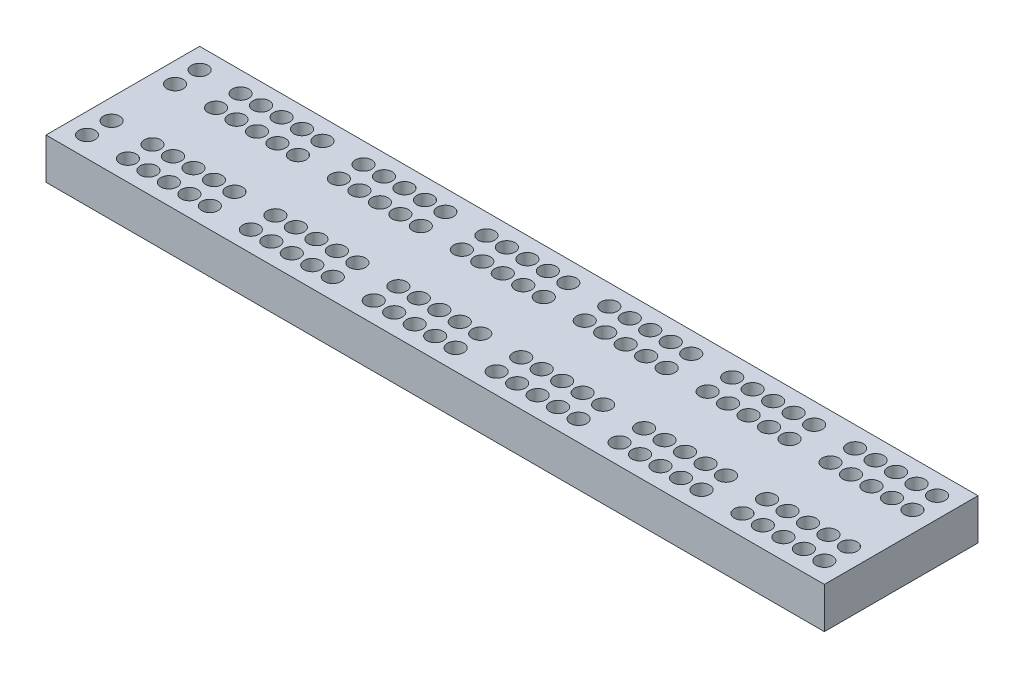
from build123d import *

# Parameters (mm, degrees)
SKETCH1_W            = 75
SKETCH1_H            = 20
BOSS_EXTRUDE1_DEPTH  = 190
LPATTERN1_COUNT      = 37
LPATTERN1_PITCH      = 10
LPATTERN1_COUNT_DIR2 = 2
LPATTERN1_PITCH_DIR2 = 12


with BuildPart() as part:
    # Sketch1 → Boss-Extrude1 (new, symmetric)
    with BuildSketch(Plane(origin=(0, 0, 0), x_dir=(0, 0, -1), z_dir=(1, 0, 0))):
        Rectangle(SKETCH1_W, SKETCH1_H)
    extrude(amount=BOSS_EXTRUDE1_DEPTH, both=True)

    # Sketch2 → 8.0 _8_ Diameter Hole1 (revolve, cut)
    with BuildSketch(Plane(origin=(-180, 10, -27.5), x_dir=(0, 0, 1), z_dir=(1, 0, 0))):
        Polygon((0, 0), (0, 14.403442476), (4, 12), (4, 0), align=None)
    f_8_0_8_diameter_hole1 = revolve(axis=Axis((-180, 16.35, -27.5), (0, -1, 0)), mode=Mode.SUBTRACT)

    # LPattern1: 8.0 _8_ Diameter Hole1 37 × 2, 12 skipped
    with Locations(*[(i * LPATTERN1_PITCH, 0, j * LPATTERN1_PITCH_DIR2) for i in range(LPATTERN1_COUNT) for j in range(LPATTERN1_COUNT_DIR2) if (i, j) not in ((0, 0), (1, 0), (1, 1), (7, 0), (7, 1), (13, 0), (13, 1), (19, 0), (19, 1), (25, 0), (25, 1), (31, 0), (31, 1))]):
        add(f_8_0_8_diameter_hole1, mode=Mode.SUBTRACT)

    # Mirror1: 8.0 _8_ Diameter Hole1 across plane
    add(f_8_0_8_diameter_hole1.mirror(Plane.XY), mode=Mode.SUBTRACT)

    # Mirror1 copy 1 sketch → Mirror1 copy 1 (revolve, cut)
    with BuildSketch(Plane(origin=(-180, 10, 15.5), x_dir=(0, 0, -1), z_dir=(1, 0, 0))):
        Polygon((0, 0), (0, -14.403442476), (4, -12), (4, 0), align=None)
    revolve(axis=Axis((-180, 16.35, 15.5), (0, 1, 0)), mode=Mode.SUBTRACT)

    # Mirror1 copy 2 sketch → Mirror1 copy 2 (revolve, cut)
    with BuildSketch(Plane(origin=(-160, 10, 27.5), x_dir=(0, 0, -1), z_dir=(1, 0, 0))):
        Polygon((0, 0), (0, -14.403442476), (4, -12), (4, 0), align=None)
    revolve(axis=Axis((-160, 16.35, 27.5), (0, 1, 0)), mode=Mode.SUBTRACT)

    # Mirror1 copy 3 sketch → Mirror1 copy 3 (revolve, cut)
    with BuildSketch(Plane(origin=(-160, 10, 15.5), x_dir=(0, 0, -1), z_dir=(1, 0, 0))):
        Polygon((0, 0), (0, -14.403442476), (4, -12), (4, 0), align=None)
    revolve(axis=Axis((-160, 16.35, 15.5), (0, 1, 0)), mode=Mode.SUBTRACT)

    # Mirror1 copy 4 sketch → Mirror1 copy 4 (revolve, cut)
    with BuildSketch(Plane(origin=(-150, 10, 27.5), x_dir=(0, 0, -1), z_dir=(1, 0, 0))):
        Polygon((0, 0), (0, -14.403442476), (4, -12), (4, 0), align=None)
    revolve(axis=Axis((-150, 16.35, 27.5), (0, 1, 0)), mode=Mode.SUBTRACT)

    # Mirror1 copy 5 sketch → Mirror1 copy 5 (revolve, cut)
    with BuildSketch(Plane(origin=(-150, 10, 15.5), x_dir=(0, 0, -1), z_dir=(1, 0, 0))):
        Polygon((0, 0), (0, -14.403442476), (4, -12), (4, 0), align=None)
    revolve(axis=Axis((-150, 16.35, 15.5), (0, 1, 0)), mode=Mode.SUBTRACT)

    # Mirror1 copy 6 sketch → Mirror1 copy 6 (revolve, cut)
    with BuildSketch(Plane(origin=(-140, 10, 27.5), x_dir=(0, 0, -1), z_dir=(1, 0, 0))):
        Polygon((0, 0), (0, -14.403442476), (4, -12), (4, 0), align=None)
    revolve(axis=Axis((-140, 16.35, 27.5), (0, 1, 0)), mode=Mode.SUBTRACT)

    # Mirror1 copy 7 sketch → Mirror1 copy 7 (revolve, cut)
    with BuildSketch(Plane(origin=(-140, 10, 15.5), x_dir=(0, 0, -1), z_dir=(1, 0, 0))):
        Polygon((0, 0), (0, -14.403442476), (4, -12), (4, 0), align=None)
    revolve(axis=Axis((-140, 16.35, 15.5), (0, 1, 0)), mode=Mode.SUBTRACT)

    # Mirror1 copy 8 sketch → Mirror1 copy 8 (revolve, cut)
    with BuildSketch(Plane(origin=(-130, 10, 27.5), x_dir=(0, 0, -1), z_dir=(1, 0, 0))):
        Polygon((0, 0), (0, -14.403442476), (4, -12), (4, 0), align=None)
    revolve(axis=Axis((-130, 16.35, 27.5), (0, 1, 0)), mode=Mode.SUBTRACT)

    # Mirror1 copy 9 sketch → Mirror1 copy 9 (revolve, cut)
    with BuildSketch(Plane(origin=(-130, 10, 15.5), x_dir=(0, 0, -1), z_dir=(1, 0, 0))):
        Polygon((0, 0), (0, -14.403442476), (4, -12), (4, 0), align=None)
    revolve(axis=Axis((-130, 16.35, 15.5), (0, 1, 0)), mode=Mode.SUBTRACT)

    # Mirror1 copy 10 sketch → Mirror1 copy 10 (revolve, cut)
    with BuildSketch(Plane(origin=(-120, 10, 27.5), x_dir=(0, 0, -1), z_dir=(1, 0, 0))):
        Polygon((0, 0), (0, -14.403442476), (4, -12), (4, 0), align=None)
    revolve(axis=Axis((-120, 16.35, 27.5), (0, 1, 0)), mode=Mode.SUBTRACT)

    # Mirror1 copy 11 sketch → Mirror1 copy 11 (revolve, cut)
    with BuildSketch(Plane(origin=(-120, 10, 15.5), x_dir=(0, 0, -1), z_dir=(1, 0, 0))):
        Polygon((0, 0), (0, -14.403442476), (4, -12), (4, 0), align=None)
    revolve(axis=Axis((-120, 16.35, 15.5), (0, 1, 0)), mode=Mode.SUBTRACT)

    # Mirror1 copy 12 sketch → Mirror1 copy 12 (revolve, cut)
    with BuildSketch(Plane(origin=(-100, 10, 27.5), x_dir=(0, 0, -1), z_dir=(1, 0, 0))):
        Polygon((0, 0), (0, -14.403442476), (4, -12), (4, 0), align=None)
    revolve(axis=Axis((-100, 16.35, 27.5), (0, 1, 0)), mode=Mode.SUBTRACT)

    # Mirror1 copy 13 sketch → Mirror1 copy 13 (revolve, cut)
    with BuildSketch(Plane(origin=(-100, 10, 15.5), x_dir=(0, 0, -1), z_dir=(1, 0, 0))):
        Polygon((0, 0), (0, -14.403442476), (4, -12), (4, 0), align=None)
    revolve(axis=Axis((-100, 16.35, 15.5), (0, 1, 0)), mode=Mode.SUBTRACT)

    # Mirror1 copy 14 sketch → Mirror1 copy 14 (revolve, cut)
    with BuildSketch(Plane(origin=(-90, 10, 27.5), x_dir=(0, 0, -1), z_dir=(1, 0, 0))):
        Polygon((0, 0), (0, -14.403442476), (4, -12), (4, 0), align=None)
    revolve(axis=Axis((-90, 16.35, 27.5), (0, 1, 0)), mode=Mode.SUBTRACT)

    # Mirror1 copy 15 sketch → Mirror1 copy 15 (revolve, cut)
    with BuildSketch(Plane(origin=(-90, 10, 15.5), x_dir=(0, 0, -1), z_dir=(1, 0, 0))):
        Polygon((0, 0), (0, -14.403442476), (4, -12), (4, 0), align=None)
    revolve(axis=Axis((-90, 16.35, 15.5), (0, 1, 0)), mode=Mode.SUBTRACT)

    # Mirror1 copy 16 sketch → Mirror1 copy 16 (revolve, cut)
    with BuildSketch(Plane(origin=(-80, 10, 27.5), x_dir=(0, 0, -1), z_dir=(1, 0, 0))):
        Polygon((0, 0), (0, -14.403442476), (4, -12), (4, 0), align=None)
    revolve(axis=Axis((-80, 16.35, 27.5), (0, 1, 0)), mode=Mode.SUBTRACT)

    # Mirror1 copy 17 sketch → Mirror1 copy 17 (revolve, cut)
    with BuildSketch(Plane(origin=(-80, 10, 15.5), x_dir=(0, 0, -1), z_dir=(1, 0, 0))):
        Polygon((0, 0), (0, -14.403442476), (4, -12), (4, 0), align=None)
    revolve(axis=Axis((-80, 16.35, 15.5), (0, 1, 0)), mode=Mode.SUBTRACT)

    # Mirror1 copy 18 sketch → Mirror1 copy 18 (revolve, cut)
    with BuildSketch(Plane(origin=(-70, 10, 27.5), x_dir=(0, 0, -1), z_dir=(1, 0, 0))):
        Polygon((0, 0), (0, -14.403442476), (4, -12), (4, 0), align=None)
    revolve(axis=Axis((-70, 16.35, 27.5), (0, 1, 0)), mode=Mode.SUBTRACT)

    # Mirror1 copy 19 sketch → Mirror1 copy 19 (revolve, cut)
    with BuildSketch(Plane(origin=(-70, 10, 15.5), x_dir=(0, 0, -1), z_dir=(1, 0, 0))):
        Polygon((0, 0), (0, -14.403442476), (4, -12), (4, 0), align=None)
    revolve(axis=Axis((-70, 16.35, 15.5), (0, 1, 0)), mode=Mode.SUBTRACT)

    # Mirror1 copy 20 sketch → Mirror1 copy 20 (revolve, cut)
    with BuildSketch(Plane(origin=(-60, 10, 27.5), x_dir=(0, 0, -1), z_dir=(1, 0, 0))):
        Polygon((0, 0), (0, -14.403442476), (4, -12), (4, 0), align=None)
    revolve(axis=Axis((-60, 16.35, 27.5), (0, 1, 0)), mode=Mode.SUBTRACT)

    # Mirror1 copy 21 sketch → Mirror1 copy 21 (revolve, cut)
    with BuildSketch(Plane(origin=(-60, 10, 15.5), x_dir=(0, 0, -1), z_dir=(1, 0, 0))):
        Polygon((0, 0), (0, -14.403442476), (4, -12), (4, 0), align=None)
    revolve(axis=Axis((-60, 16.35, 15.5), (0, 1, 0)), mode=Mode.SUBTRACT)

    # Mirror1 copy 22 sketch → Mirror1 copy 22 (revolve, cut)
    with BuildSketch(Plane(origin=(-40, 10, 27.5), x_dir=(0, 0, -1), z_dir=(1, 0, 0))):
        Polygon((0, 0), (0, -14.403442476), (4, -12), (4, 0), align=None)
    revolve(axis=Axis((-40, 16.35, 27.5), (0, 1, 0)), mode=Mode.SUBTRACT)

    # Mirror1 copy 23 sketch → Mirror1 copy 23 (revolve, cut)
    with BuildSketch(Plane(origin=(-40, 10, 15.5), x_dir=(0, 0, -1), z_dir=(1, 0, 0))):
        Polygon((0, 0), (0, -14.403442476), (4, -12), (4, 0), align=None)
    revolve(axis=Axis((-40, 16.35, 15.5), (0, 1, 0)), mode=Mode.SUBTRACT)

    # Mirror1 copy 24 sketch → Mirror1 copy 24 (revolve, cut)
    with BuildSketch(Plane(origin=(-30, 10, 27.5), x_dir=(0, 0, -1), z_dir=(1, 0, 0))):
        Polygon((0, 0), (0, -14.403442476), (4, -12), (4, 0), align=None)
    revolve(axis=Axis((-30, 16.35, 27.5), (0, 1, 0)), mode=Mode.SUBTRACT)

    # Mirror1 copy 25 sketch → Mirror1 copy 25 (revolve, cut)
    with BuildSketch(Plane(origin=(-30, 10, 15.5), x_dir=(0, 0, -1), z_dir=(1, 0, 0))):
        Polygon((0, 0), (0, -14.403442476), (4, -12), (4, 0), align=None)
    revolve(axis=Axis((-30, 16.35, 15.5), (0, 1, 0)), mode=Mode.SUBTRACT)

    # Mirror1 copy 26 sketch → Mirror1 copy 26 (revolve, cut)
    with BuildSketch(Plane(origin=(-20, 10, 27.5), x_dir=(0, 0, -1), z_dir=(1, 0, 0))):
        Polygon((0, 0), (0, -14.403442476), (4, -12), (4, 0), align=None)
    revolve(axis=Axis((-20, 16.35, 27.5), (0, 1, 0)), mode=Mode.SUBTRACT)

    # Mirror1 copy 27 sketch → Mirror1 copy 27 (revolve, cut)
    with BuildSketch(Plane(origin=(-20, 10, 15.5), x_dir=(0, 0, -1), z_dir=(1, 0, 0))):
        Polygon((0, 0), (0, -14.403442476), (4, -12), (4, 0), align=None)
    revolve(axis=Axis((-20, 16.35, 15.5), (0, 1, 0)), mode=Mode.SUBTRACT)

    # Mirror1 copy 28 sketch → Mirror1 copy 28 (revolve, cut)
    with BuildSketch(Plane(origin=(-10, 10, 27.5), x_dir=(0, 0, -1), z_dir=(1, 0, 0))):
        Polygon((0, 0), (0, -14.403442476), (4, -12), (4, 0), align=None)
    revolve(axis=Axis((-10, 16.35, 27.5), (0, 1, 0)), mode=Mode.SUBTRACT)

    # Mirror1 copy 29 sketch → Mirror1 copy 29 (revolve, cut)
    with BuildSketch(Plane(origin=(-10, 10, 15.5), x_dir=(0, 0, -1), z_dir=(1, 0, 0))):
        Polygon((0, 0), (0, -14.403442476), (4, -12), (4, 0), align=None)
    revolve(axis=Axis((-10, 16.35, 15.5), (0, 1, 0)), mode=Mode.SUBTRACT)

    # Mirror1 copy 30 sketch → Mirror1 copy 30 (revolve, cut)
    with BuildSketch(Plane(origin=(0, 10, 27.5), x_dir=(0, 0, -1), z_dir=(1, 0, 0))):
        Polygon((0, 0), (0, -14.403442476), (4, -12), (4, 0), align=None)
    revolve(axis=Axis((0, 16.35, 27.5), (0, 1, 0)), mode=Mode.SUBTRACT)

    # Mirror1 copy 31 sketch → Mirror1 copy 31 (revolve, cut)
    with BuildSketch(Plane(origin=(0, 10, 15.5), x_dir=(0, 0, -1), z_dir=(1, 0, 0))):
        Polygon((0, 0), (0, -14.403442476), (4, -12), (4, 0), align=None)
    revolve(axis=Axis((0, 16.35, 15.5), (0, 1, 0)), mode=Mode.SUBTRACT)

    # Mirror1 copy 32 sketch → Mirror1 copy 32 (revolve, cut)
    with BuildSketch(Plane(origin=(20, 10, 27.5), x_dir=(0, 0, -1), z_dir=(1, 0, 0))):
        Polygon((0, 0), (0, -14.403442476), (4, -12), (4, 0), align=None)
    revolve(axis=Axis((20, 16.35, 27.5), (0, 1, 0)), mode=Mode.SUBTRACT)

    # Mirror1 copy 33 sketch → Mirror1 copy 33 (revolve, cut)
    with BuildSketch(Plane(origin=(20, 10, 15.5), x_dir=(0, 0, -1), z_dir=(1, 0, 0))):
        Polygon((0, 0), (0, -14.403442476), (4, -12), (4, 0), align=None)
    revolve(axis=Axis((20, 16.35, 15.5), (0, 1, 0)), mode=Mode.SUBTRACT)

    # Mirror1 copy 34 sketch → Mirror1 copy 34 (revolve, cut)
    with BuildSketch(Plane(origin=(30, 10, 27.5), x_dir=(0, 0, -1), z_dir=(1, 0, 0))):
        Polygon((0, 0), (0, -14.403442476), (4, -12), (4, 0), align=None)
    revolve(axis=Axis((30, 16.35, 27.5), (0, 1, 0)), mode=Mode.SUBTRACT)

    # Mirror1 copy 35 sketch → Mirror1 copy 35 (revolve, cut)
    with BuildSketch(Plane(origin=(30, 10, 15.5), x_dir=(0, 0, -1), z_dir=(1, 0, 0))):
        Polygon((0, 0), (0, -14.403442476), (4, -12), (4, 0), align=None)
    revolve(axis=Axis((30, 16.35, 15.5), (0, 1, 0)), mode=Mode.SUBTRACT)

    # Mirror1 copy 36 sketch → Mirror1 copy 36 (revolve, cut)
    with BuildSketch(Plane(origin=(40, 10, 27.5), x_dir=(0, 0, -1), z_dir=(1, 0, 0))):
        Polygon((0, 0), (0, -14.403442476), (4, -12), (4, 0), align=None)
    revolve(axis=Axis((40, 16.35, 27.5), (0, 1, 0)), mode=Mode.SUBTRACT)

    # Mirror1 copy 37 sketch → Mirror1 copy 37 (revolve, cut)
    with BuildSketch(Plane(origin=(40, 10, 15.5), x_dir=(0, 0, -1), z_dir=(1, 0, 0))):
        Polygon((0, 0), (0, -14.403442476), (4, -12), (4, 0), align=None)
    revolve(axis=Axis((40, 16.35, 15.5), (0, 1, 0)), mode=Mode.SUBTRACT)

    # Mirror1 copy 38 sketch → Mirror1 copy 38 (revolve, cut)
    with BuildSketch(Plane(origin=(50, 10, 27.5), x_dir=(0, 0, -1), z_dir=(1, 0, 0))):
        Polygon((0, 0), (0, -14.403442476), (4, -12), (4, 0), align=None)
    revolve(axis=Axis((50, 16.35, 27.5), (0, 1, 0)), mode=Mode.SUBTRACT)

    # Mirror1 copy 39 sketch → Mirror1 copy 39 (revolve, cut)
    with BuildSketch(Plane(origin=(50, 10, 15.5), x_dir=(0, 0, -1), z_dir=(1, 0, 0))):
        Polygon((0, 0), (0, -14.403442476), (4, -12), (4, 0), align=None)
    revolve(axis=Axis((50, 16.35, 15.5), (0, 1, 0)), mode=Mode.SUBTRACT)

    # Mirror1 copy 40 sketch → Mirror1 copy 40 (revolve, cut)
    with BuildSketch(Plane(origin=(60, 10, 27.5), x_dir=(0, 0, -1), z_dir=(1, 0, 0))):
        Polygon((0, 0), (0, -14.403442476), (4, -12), (4, 0), align=None)
    revolve(axis=Axis((60, 16.35, 27.5), (0, 1, 0)), mode=Mode.SUBTRACT)

    # Mirror1 copy 41 sketch → Mirror1 copy 41 (revolve, cut)
    with BuildSketch(Plane(origin=(60, 10, 15.5), x_dir=(0, 0, -1), z_dir=(1, 0, 0))):
        Polygon((0, 0), (0, -14.403442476), (4, -12), (4, 0), align=None)
    revolve(axis=Axis((60, 16.35, 15.5), (0, 1, 0)), mode=Mode.SUBTRACT)

    # Mirror1 copy 42 sketch → Mirror1 copy 42 (revolve, cut)
    with BuildSketch(Plane(origin=(80, 10, 27.5), x_dir=(0, 0, -1), z_dir=(1, 0, 0))):
        Polygon((0, 0), (0, -14.403442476), (4, -12), (4, 0), align=None)
    revolve(axis=Axis((80, 16.35, 27.5), (0, 1, 0)), mode=Mode.SUBTRACT)

    # Mirror1 copy 43 sketch → Mirror1 copy 43 (revolve, cut)
    with BuildSketch(Plane(origin=(80, 10, 15.5), x_dir=(0, 0, -1), z_dir=(1, 0, 0))):
        Polygon((0, 0), (0, -14.403442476), (4, -12), (4, 0), align=None)
    revolve(axis=Axis((80, 16.35, 15.5), (0, 1, 0)), mode=Mode.SUBTRACT)

    # Mirror1 copy 44 sketch → Mirror1 copy 44 (revolve, cut)
    with BuildSketch(Plane(origin=(90, 10, 27.5), x_dir=(0, 0, -1), z_dir=(1, 0, 0))):
        Polygon((0, 0), (0, -14.403442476), (4, -12), (4, 0), align=None)
    revolve(axis=Axis((90, 16.35, 27.5), (0, 1, 0)), mode=Mode.SUBTRACT)

    # Mirror1 copy 45 sketch → Mirror1 copy 45 (revolve, cut)
    with BuildSketch(Plane(origin=(90, 10, 15.5), x_dir=(0, 0, -1), z_dir=(1, 0, 0))):
        Polygon((0, 0), (0, -14.403442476), (4, -12), (4, 0), align=None)
    revolve(axis=Axis((90, 16.35, 15.5), (0, 1, 0)), mode=Mode.SUBTRACT)

    # Mirror1 copy 46 sketch → Mirror1 copy 46 (revolve, cut)
    with BuildSketch(Plane(origin=(100, 10, 27.5), x_dir=(0, 0, -1), z_dir=(1, 0, 0))):
        Polygon((0, 0), (0, -14.403442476), (4, -12), (4, 0), align=None)
    revolve(axis=Axis((100, 16.35, 27.5), (0, 1, 0)), mode=Mode.SUBTRACT)

    # Mirror1 copy 47 sketch → Mirror1 copy 47 (revolve, cut)
    with BuildSketch(Plane(origin=(100, 10, 15.5), x_dir=(0, 0, -1), z_dir=(1, 0, 0))):
        Polygon((0, 0), (0, -14.403442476), (4, -12), (4, 0), align=None)
    revolve(axis=Axis((100, 16.35, 15.5), (0, 1, 0)), mode=Mode.SUBTRACT)

    # Mirror1 copy 48 sketch → Mirror1 copy 48 (revolve, cut)
    with BuildSketch(Plane(origin=(110, 10, 27.5), x_dir=(0, 0, -1), z_dir=(1, 0, 0))):
        Polygon((0, 0), (0, -14.403442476), (4, -12), (4, 0), align=None)
    revolve(axis=Axis((110, 16.35, 27.5), (0, 1, 0)), mode=Mode.SUBTRACT)

    # Mirror1 copy 49 sketch → Mirror1 copy 49 (revolve, cut)
    with BuildSketch(Plane(origin=(110, 10, 15.5), x_dir=(0, 0, -1), z_dir=(1, 0, 0))):
        Polygon((0, 0), (0, -14.403442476), (4, -12), (4, 0), align=None)
    revolve(axis=Axis((110, 16.35, 15.5), (0, 1, 0)), mode=Mode.SUBTRACT)

    # Mirror1 copy 50 sketch → Mirror1 copy 50 (revolve, cut)
    with BuildSketch(Plane(origin=(120, 10, 27.5), x_dir=(0, 0, -1), z_dir=(1, 0, 0))):
        Polygon((0, 0), (0, -14.403442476), (4, -12), (4, 0), align=None)
    revolve(axis=Axis((120, 16.35, 27.5), (0, 1, 0)), mode=Mode.SUBTRACT)

    # Mirror1 copy 51 sketch → Mirror1 copy 51 (revolve, cut)
    with BuildSketch(Plane(origin=(120, 10, 15.5), x_dir=(0, 0, -1), z_dir=(1, 0, 0))):
        Polygon((0, 0), (0, -14.403442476), (4, -12), (4, 0), align=None)
    revolve(axis=Axis((120, 16.35, 15.5), (0, 1, 0)), mode=Mode.SUBTRACT)

    # Mirror1 copy 52 sketch → Mirror1 copy 52 (revolve, cut)
    with BuildSketch(Plane(origin=(140, 10, 27.5), x_dir=(0, 0, -1), z_dir=(1, 0, 0))):
        Polygon((0, 0), (0, -14.403442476), (4, -12), (4, 0), align=None)
    revolve(axis=Axis((140, 16.35, 27.5), (0, 1, 0)), mode=Mode.SUBTRACT)

    # Mirror1 copy 53 sketch → Mirror1 copy 53 (revolve, cut)
    with BuildSketch(Plane(origin=(140, 10, 15.5), x_dir=(0, 0, -1), z_dir=(1, 0, 0))):
        Polygon((0, 0), (0, -14.403442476), (4, -12), (4, 0), align=None)
    revolve(axis=Axis((140, 16.35, 15.5), (0, 1, 0)), mode=Mode.SUBTRACT)

    # Mirror1 copy 54 sketch → Mirror1 copy 54 (revolve, cut)
    with BuildSketch(Plane(origin=(150, 10, 27.5), x_dir=(0, 0, -1), z_dir=(1, 0, 0))):
        Polygon((0, 0), (0, -14.403442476), (4, -12), (4, 0), align=None)
    revolve(axis=Axis((150, 16.35, 27.5), (0, 1, 0)), mode=Mode.SUBTRACT)

    # Mirror1 copy 55 sketch → Mirror1 copy 55 (revolve, cut)
    with BuildSketch(Plane(origin=(150, 10, 15.5), x_dir=(0, 0, -1), z_dir=(1, 0, 0))):
        Polygon((0, 0), (0, -14.403442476), (4, -12), (4, 0), align=None)
    revolve(axis=Axis((150, 16.35, 15.5), (0, 1, 0)), mode=Mode.SUBTRACT)

    # Mirror1 copy 56 sketch → Mirror1 copy 56 (revolve, cut)
    with BuildSketch(Plane(origin=(160, 10, 27.5), x_dir=(0, 0, -1), z_dir=(1, 0, 0))):
        Polygon((0, 0), (0, -14.403442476), (4, -12), (4, 0), align=None)
    revolve(axis=Axis((160, 16.35, 27.5), (0, 1, 0)), mode=Mode.SUBTRACT)

    # Mirror1 copy 57 sketch → Mirror1 copy 57 (revolve, cut)
    with BuildSketch(Plane(origin=(160, 10, 15.5), x_dir=(0, 0, -1), z_dir=(1, 0, 0))):
        Polygon((0, 0), (0, -14.403442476), (4, -12), (4, 0), align=None)
    revolve(axis=Axis((160, 16.35, 15.5), (0, 1, 0)), mode=Mode.SUBTRACT)

    # Mirror1 copy 58 sketch → Mirror1 copy 58 (revolve, cut)
    with BuildSketch(Plane(origin=(170, 10, 27.5), x_dir=(0, 0, -1), z_dir=(1, 0, 0))):
        Polygon((0, 0), (0, -14.403442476), (4, -12), (4, 0), align=None)
    revolve(axis=Axis((170, 16.35, 27.5), (0, 1, 0)), mode=Mode.SUBTRACT)

    # Mirror1 copy 59 sketch → Mirror1 copy 59 (revolve, cut)
    with BuildSketch(Plane(origin=(170, 10, 15.5), x_dir=(0, 0, -1), z_dir=(1, 0, 0))):
        Polygon((0, 0), (0, -14.403442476), (4, -12), (4, 0), align=None)
    revolve(axis=Axis((170, 16.35, 15.5), (0, 1, 0)), mode=Mode.SUBTRACT)

    # Mirror1 copy 60 sketch → Mirror1 copy 60 (revolve, cut)
    with BuildSketch(Plane(origin=(180, 10, 27.5), x_dir=(0, 0, -1), z_dir=(1, 0, 0))):
        Polygon((0, 0), (0, -14.403442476), (4, -12), (4, 0), align=None)
    revolve(axis=Axis((180, 16.35, 27.5), (0, 1, 0)), mode=Mode.SUBTRACT)

    # Mirror1 copy 61 sketch → Mirror1 copy 61 (revolve, cut)
    with BuildSketch(Plane(origin=(180, 10, 15.5), x_dir=(0, 0, -1), z_dir=(1, 0, 0))):
        Polygon((0, 0), (0, -14.403442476), (4, -12), (4, 0), align=None)
    revolve(axis=Axis((180, 16.35, 15.5), (0, 1, 0)), mode=Mode.SUBTRACT)


solid = part.part
